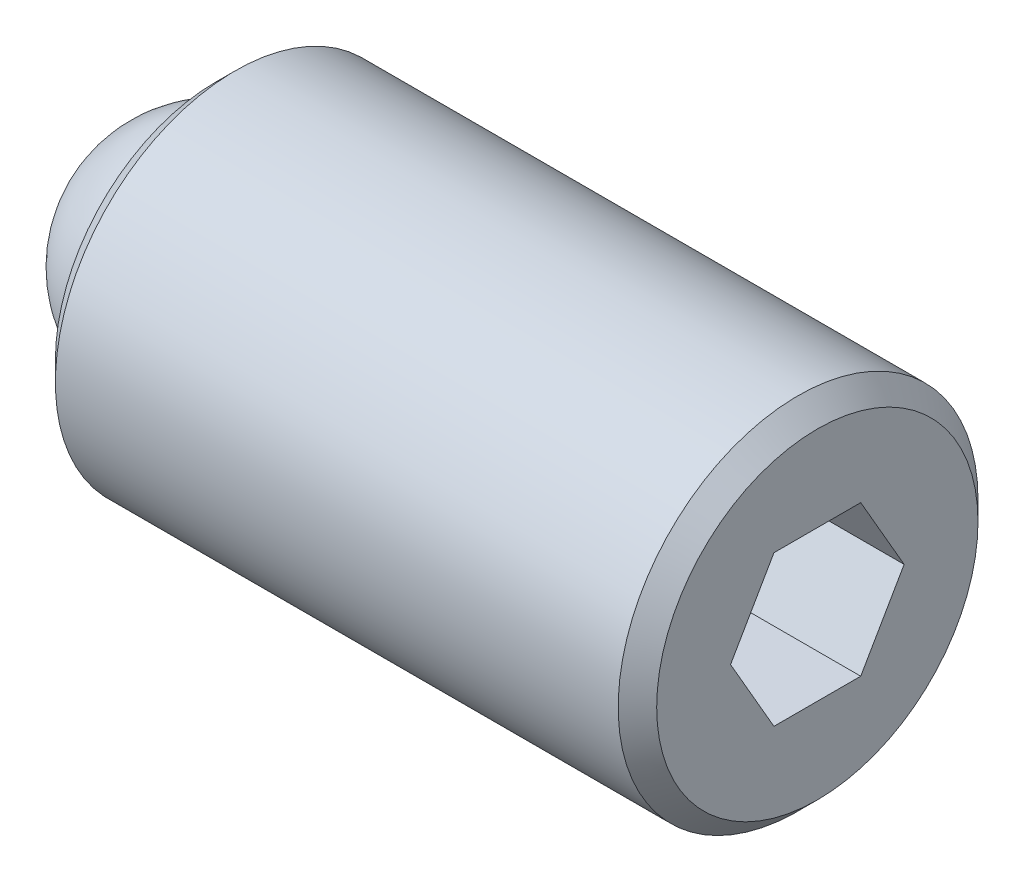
ISO-10303-21;
HEADER;
FILE_DESCRIPTION(('STEP AP214'),'2;1');
FILE_NAME('part.step','',(''),(''),'','','');
FILE_SCHEMA(('AUTOMOTIVE_DESIGN { 1 0 10303 214 1 1 1 1 }'));
ENDSEC;
DATA;
#1=APPLICATION_CONTEXT('core data for automotive mechanical design processes');
#2=APPLICATION_PROTOCOL_DEFINITION('international standard','automotive_design',2000,#1);
#3=PRODUCT_CONTEXT('',#1,'mechanical');
#4=PRODUCT('Part','Part','',(#3));
#5=PRODUCT_RELATED_PRODUCT_CATEGORY('part','',(#4));
#6=PRODUCT_DEFINITION_FORMATION('','',#4);
#7=PRODUCT_DEFINITION_CONTEXT('part definition',#1,'design');
#8=PRODUCT_DEFINITION('design','',#6,#7);
#9=PRODUCT_DEFINITION_SHAPE('','',#8);
#10=(LENGTH_UNIT() NAMED_UNIT(*) SI_UNIT(.MILLI.,.METRE.));
#11=(NAMED_UNIT(*) PLANE_ANGLE_UNIT() SI_UNIT($,.RADIAN.));
#12=(NAMED_UNIT(*) SI_UNIT($,.STERADIAN.) SOLID_ANGLE_UNIT());
#13=UNCERTAINTY_MEASURE_WITH_UNIT(LENGTH_MEASURE(1.E-05),#10,'distance_accuracy_value','');
#14=(GEOMETRIC_REPRESENTATION_CONTEXT(3) GLOBAL_UNCERTAINTY_ASSIGNED_CONTEXT((#13)) GLOBAL_UNIT_ASSIGNED_CONTEXT((#10,
#11,#12)) REPRESENTATION_CONTEXT('',''));
#15=CARTESIAN_POINT('',(0.,0.,0.));
#16=DIRECTION('',(0.,0.,1.));
#17=DIRECTION('',(1.,0.,0.));
#18=AXIS2_PLACEMENT_3D('',#15,#16,#17);
#19=CARTESIAN_POINT('',(0.,0.,0.));
#20=DIRECTION('',(0.,-1.,0.));
#21=DIRECTION('',(0.,0.,1.));
#22=AXIS2_PLACEMENT_3D('',#19,#20,#21);
#23=SPHERICAL_SURFACE('',#22,1.5875);
#24=CARTESIAN_POINT('',(0.,-1.5875,0.));
#25=VERTEX_POINT('',#24);
#26=VERTEX_LOOP('',#25);
#27=FACE_BOUND('',#26,.T.);
#28=ADVANCED_FACE('F40',(#27),#23,.T.);
#29=CLOSED_SHELL('',(#28));
#30=MANIFOLD_SOLID_BREP('B2',#29);
#31=CARTESIAN_POINT('',(7.9375,0.,0.));
#32=DIRECTION('',(-1.,0.,0.));
#33=DIRECTION('',(0.,0.,1.));
#34=AXIS2_PLACEMENT_3D('',#31,#32,#33);
#35=CYLINDRICAL_SURFACE('',#34,2.3749);
#36=CARTESIAN_POINT('',(7.6835,0.,0.));
#37=DIRECTION('',(1.,0.,0.));
#38=DIRECTION('',(0.,0.,-1.));
#39=AXIS2_PLACEMENT_3D('',#36,#37,#38);
#40=CIRCLE('',#39,2.3749);
#41=CARTESIAN_POINT('',(7.6835,0.,-2.3749));
#42=VERTEX_POINT('',#41);
#43=EDGE_CURVE('E38',#42,#42,#40,.F.);
#44=ORIENTED_EDGE('',*,*,#43,.T.);
#45=EDGE_LOOP('',(#44));
#46=FACE_BOUND('',#45,.T.);
#47=CARTESIAN_POINT('',(0.254,0.,0.));
#48=DIRECTION('',(1.,0.,0.));
#49=DIRECTION('',(0.,0.,-1.));
#50=AXIS2_PLACEMENT_3D('',#47,#48,#49);
#51=CIRCLE('',#50,2.3749);
#52=CARTESIAN_POINT('',(0.254,0.,-2.3749));
#53=VERTEX_POINT('',#52);
#54=EDGE_CURVE('E155',#53,#53,#51,.T.);
#55=ORIENTED_EDGE('',*,*,#54,.T.);
#56=EDGE_LOOP('',(#55));
#57=FACE_BOUND('',#56,.T.);
#58=ADVANCED_FACE('F52',(#46,#57),#35,.T.);
#59=CARTESIAN_POINT('',(7.9375,0.,0.));
#60=DIRECTION('',(1.,0.,0.));
#61=DIRECTION('',(0.,0.,-1.));
#62=AXIS2_PLACEMENT_3D('',#59,#60,#61);
#63=PLANE('',#62);
#64=DIRECTION('',(0.,0.866025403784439,-0.5));
#65=VECTOR('',#64,1.);
#66=CARTESIAN_POINT('',(7.9375,-0.992187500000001,-0.572839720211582));
#67=LINE('',#66,#65);
#68=CARTESIAN_POINT('',(7.9375,-0.992187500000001,-0.572839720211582));
#69=VERTEX_POINT('',#68);
#70=CARTESIAN_POINT('',(7.9375,0.,-1.14567944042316));
#71=VERTEX_POINT('',#70);
#72=EDGE_CURVE('E67',#69,#71,#67,.T.);
#73=ORIENTED_EDGE('',*,*,#72,.F.);
#74=DIRECTION('',(0.,0.,-1.));
#75=VECTOR('',#74,1.);
#76=CARTESIAN_POINT('',(7.9375,-0.992187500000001,0.572839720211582));
#77=LINE('',#76,#75);
#78=CARTESIAN_POINT('',(7.9375,-0.992187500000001,0.572839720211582));
#79=VERTEX_POINT('',#78);
#80=EDGE_CURVE('E151',#79,#69,#77,.T.);
#81=ORIENTED_EDGE('',*,*,#80,.F.);
#82=DIRECTION('',(0.,-0.866025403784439,-0.5));
#83=VECTOR('',#82,1.);
#84=CARTESIAN_POINT('',(7.9375,0.,1.14567944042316));
#85=LINE('',#84,#83);
#86=CARTESIAN_POINT('',(7.9375,0.,1.14567944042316));
#87=VERTEX_POINT('',#86);
#88=EDGE_CURVE('E149',#87,#79,#85,.T.);
#89=ORIENTED_EDGE('',*,*,#88,.F.);
#90=DIRECTION('',(0.,-0.866025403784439,0.5));
#91=VECTOR('',#90,1.);
#92=CARTESIAN_POINT('',(7.9375,0.992187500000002,0.572839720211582));
#93=LINE('',#92,#91);
#94=CARTESIAN_POINT('',(7.9375,0.992187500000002,0.572839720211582));
#95=VERTEX_POINT('',#94);
#96=EDGE_CURVE('E115',#95,#87,#93,.T.);
#97=ORIENTED_EDGE('',*,*,#96,.F.);
#98=DIRECTION('',(0.,0.,1.));
#99=VECTOR('',#98,1.);
#100=CARTESIAN_POINT('',(7.9375,0.992187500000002,-0.572839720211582));
#101=LINE('',#100,#99);
#102=CARTESIAN_POINT('',(7.9375,0.992187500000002,-0.572839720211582));
#103=VERTEX_POINT('',#102);
#104=EDGE_CURVE('E145',#103,#95,#101,.T.);
#105=ORIENTED_EDGE('',*,*,#104,.F.);
#106=DIRECTION('',(0.,0.866025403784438,0.5));
#107=VECTOR('',#106,1.);
#108=CARTESIAN_POINT('',(7.9375,0.,-1.14567944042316));
#109=LINE('',#108,#107);
#110=EDGE_CURVE('E141',#71,#103,#109,.T.);
#111=ORIENTED_EDGE('',*,*,#110,.F.);
#112=EDGE_LOOP('',(#73,#81,#89,#97,#105,#111));
#113=FACE_BOUND('',#112,.T.);
#114=CARTESIAN_POINT('',(7.9375,0.,0.));
#115=DIRECTION('',(1.,0.,0.));
#116=DIRECTION('',(0.,0.,-1.));
#117=AXIS2_PLACEMENT_3D('',#114,#115,#116);
#118=CIRCLE('',#117,2.1209);
#119=CARTESIAN_POINT('',(7.9375,0.,-2.1209));
#120=VERTEX_POINT('',#119);
#121=EDGE_CURVE('E60',#120,#120,#118,.T.);
#122=ORIENTED_EDGE('',*,*,#121,.T.);
#123=EDGE_LOOP('',(#122));
#124=FACE_BOUND('',#123,.T.);
#125=ADVANCED_FACE('F168',(#113,#124),#63,.T.);
#126=CARTESIAN_POINT('',(0.,0.,0.));
#127=DIRECTION('',(1.,0.,0.));
#128=DIRECTION('',(0.,0.,-1.));
#129=AXIS2_PLACEMENT_3D('',#126,#127,#128);
#130=PLANE('',#129);
#131=CARTESIAN_POINT('',(0.,0.,0.));
#132=DIRECTION('',(-1.,0.,0.));
#133=DIRECTION('',(0.,0.,1.));
#134=AXIS2_PLACEMENT_3D('',#131,#132,#133);
#135=CIRCLE('',#134,1.5875);
#136=CARTESIAN_POINT('',(0.,0.,1.5875));
#137=VERTEX_POINT('',#136);
#138=EDGE_CURVE('E223',#137,#137,#135,.T.);
#139=ORIENTED_EDGE('',*,*,#138,.F.);
#140=EDGE_LOOP('',(#139));
#141=FACE_BOUND('',#140,.T.);
#142=CARTESIAN_POINT('',(0.,0.,0.));
#143=DIRECTION('',(1.,0.,0.));
#144=DIRECTION('',(0.,0.,-1.));
#145=AXIS2_PLACEMENT_3D('',#142,#143,#144);
#146=CIRCLE('',#145,2.1209);
#147=CARTESIAN_POINT('',(0.,0.,-2.1209));
#148=VERTEX_POINT('',#147);
#149=EDGE_CURVE('E163',#148,#148,#146,.F.);
#150=ORIENTED_EDGE('',*,*,#149,.T.);
#151=EDGE_LOOP('',(#150));
#152=FACE_BOUND('',#151,.T.);
#153=ADVANCED_FACE('F180',(#141,#152),#130,.F.);
#154=CARTESIAN_POINT('',(0.254,0.,0.));
#155=DIRECTION('',(1.,0.,0.));
#156=DIRECTION('',(0.,0.,-1.));
#157=AXIS2_PLACEMENT_3D('',#154,#155,#156);
#158=CONICAL_SURFACE('',#157,2.3749,0.785398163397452);
#159=ORIENTED_EDGE('',*,*,#149,.F.);
#160=EDGE_LOOP('',(#159));
#161=FACE_BOUND('',#160,.T.);
#162=ORIENTED_EDGE('',*,*,#54,.F.);
#163=EDGE_LOOP('',(#162));
#164=FACE_BOUND('',#163,.T.);
#165=ADVANCED_FACE('F172',(#161,#164),#158,.T.);
#166=CARTESIAN_POINT('',(7.9375,0.,0.));
#167=DIRECTION('',(-1.,0.,0.));
#168=DIRECTION('',(0.,0.,1.));
#169=AXIS2_PLACEMENT_3D('',#166,#167,#168);
#170=CONICAL_SURFACE('',#169,2.1209,0.785398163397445);
#171=ORIENTED_EDGE('',*,*,#43,.F.);
#172=EDGE_LOOP('',(#171));
#173=FACE_BOUND('',#172,.T.);
#174=ORIENTED_EDGE('',*,*,#121,.F.);
#175=EDGE_LOOP('',(#174));
#176=FACE_BOUND('',#175,.T.);
#177=ADVANCED_FACE('F54',(#173,#176),#170,.T.);
#178=CARTESIAN_POINT('',(5.6515,-0.992187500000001,-0.572839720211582));
#179=DIRECTION('',(0.,-0.5,-0.866025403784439));
#180=DIRECTION('',(0.,0.866025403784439,-0.5));
#181=AXIS2_PLACEMENT_3D('',#178,#179,#180);
#182=PLANE('',#181);
#183=ORIENTED_EDGE('',*,*,#72,.T.);
#184=DIRECTION('',(1.,0.,0.));
#185=VECTOR('',#184,1.);
#186=CARTESIAN_POINT('',(5.6515,0.,-1.14567944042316));
#187=LINE('',#186,#185);
#188=CARTESIAN_POINT('',(5.6515,0.,-1.14567944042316));
#189=VERTEX_POINT('',#188);
#190=EDGE_CURVE('E97',#189,#71,#187,.T.);
#191=ORIENTED_EDGE('',*,*,#190,.F.);
#192=DIRECTION('',(0.,0.866025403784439,-0.5));
#193=VECTOR('',#192,1.);
#194=CARTESIAN_POINT('',(5.6515,-0.992187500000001,-0.572839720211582));
#195=LINE('',#194,#193);
#196=CARTESIAN_POINT('',(5.6515,-0.992187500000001,-0.572839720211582));
#197=VERTEX_POINT('',#196);
#198=EDGE_CURVE('E153',#197,#189,#195,.T.);
#199=ORIENTED_EDGE('',*,*,#198,.F.);
#200=DIRECTION('',(1.,0.,0.));
#201=VECTOR('',#200,1.);
#202=CARTESIAN_POINT('',(5.6515,-0.992187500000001,-0.572839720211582));
#203=LINE('',#202,#201);
#204=EDGE_CURVE('E75',#197,#69,#203,.T.);
#205=ORIENTED_EDGE('',*,*,#204,.T.);
#206=EDGE_LOOP('',(#183,#191,#199,#205));
#207=FACE_BOUND('',#206,.T.);
#208=ADVANCED_FACE('F171',(#207),#182,.F.);
#209=CARTESIAN_POINT('',(5.6515,-0.992187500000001,0.572839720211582));
#210=DIRECTION('',(0.,-1.,0.));
#211=DIRECTION('',(0.,0.,-1.));
#212=AXIS2_PLACEMENT_3D('',#209,#210,#211);
#213=PLANE('',#212);
#214=ORIENTED_EDGE('',*,*,#80,.T.);
#215=ORIENTED_EDGE('',*,*,#204,.F.);
#216=DIRECTION('',(0.,0.,-1.));
#217=VECTOR('',#216,1.);
#218=CARTESIAN_POINT('',(5.6515,-0.992187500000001,0.572839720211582));
#219=LINE('',#218,#217);
#220=CARTESIAN_POINT('',(5.6515,-0.992187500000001,0.572839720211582));
#221=VERTEX_POINT('',#220);
#222=EDGE_CURVE('E127',#221,#197,#219,.T.);
#223=ORIENTED_EDGE('',*,*,#222,.F.);
#224=DIRECTION('',(1.,0.,0.));
#225=VECTOR('',#224,1.);
#226=CARTESIAN_POINT('',(5.6515,-0.992187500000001,0.572839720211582));
#227=LINE('',#226,#225);
#228=EDGE_CURVE('E119',#221,#79,#227,.T.);
#229=ORIENTED_EDGE('',*,*,#228,.T.);
#230=EDGE_LOOP('',(#214,#215,#223,#229));
#231=FACE_BOUND('',#230,.T.);
#232=ADVANCED_FACE('F178',(#231),#213,.F.);
#233=CARTESIAN_POINT('',(5.6515,0.,1.14567944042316));
#234=DIRECTION('',(0.,-0.5,0.866025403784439));
#235=DIRECTION('',(0.,-0.866025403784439,-0.5));
#236=AXIS2_PLACEMENT_3D('',#233,#234,#235);
#237=PLANE('',#236);
#238=ORIENTED_EDGE('',*,*,#88,.T.);
#239=ORIENTED_EDGE('',*,*,#228,.F.);
#240=DIRECTION('',(0.,-0.866025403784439,-0.5));
#241=VECTOR('',#240,1.);
#242=CARTESIAN_POINT('',(5.6515,0.,1.14567944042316));
#243=LINE('',#242,#241);
#244=CARTESIAN_POINT('',(5.6515,0.,1.14567944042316));
#245=VERTEX_POINT('',#244);
#246=EDGE_CURVE('E123',#245,#221,#243,.T.);
#247=ORIENTED_EDGE('',*,*,#246,.F.);
#248=DIRECTION('',(1.,0.,0.));
#249=VECTOR('',#248,1.);
#250=CARTESIAN_POINT('',(5.6515,0.,1.14567944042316));
#251=LINE('',#250,#249);
#252=EDGE_CURVE('E108',#245,#87,#251,.T.);
#253=ORIENTED_EDGE('',*,*,#252,.T.);
#254=EDGE_LOOP('',(#238,#239,#247,#253));
#255=FACE_BOUND('',#254,.T.);
#256=ADVANCED_FACE('F124',(#255),#237,.F.);
#257=CARTESIAN_POINT('',(5.6515,0.992187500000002,0.572839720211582));
#258=DIRECTION('',(0.,0.5,0.866025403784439));
#259=DIRECTION('',(0.,-0.866025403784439,0.5));
#260=AXIS2_PLACEMENT_3D('',#257,#258,#259);
#261=PLANE('',#260);
#262=ORIENTED_EDGE('',*,*,#96,.T.);
#263=ORIENTED_EDGE('',*,*,#252,.F.);
#264=DIRECTION('',(0.,-0.866025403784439,0.5));
#265=VECTOR('',#264,1.);
#266=CARTESIAN_POINT('',(5.6515,0.992187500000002,0.572839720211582));
#267=LINE('',#266,#265);
#268=CARTESIAN_POINT('',(5.6515,0.992187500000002,0.572839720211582));
#269=VERTEX_POINT('',#268);
#270=EDGE_CURVE('E112',#269,#245,#267,.T.);
#271=ORIENTED_EDGE('',*,*,#270,.F.);
#272=DIRECTION('',(1.,0.,0.));
#273=VECTOR('',#272,1.);
#274=CARTESIAN_POINT('',(5.6515,0.992187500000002,0.572839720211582));
#275=LINE('',#274,#273);
#276=EDGE_CURVE('E120',#269,#95,#275,.T.);
#277=ORIENTED_EDGE('',*,*,#276,.T.);
#278=EDGE_LOOP('',(#262,#263,#271,#277));
#279=FACE_BOUND('',#278,.T.);
#280=ADVANCED_FACE('F110',(#279),#261,.F.);
#281=CARTESIAN_POINT('',(5.6515,0.992187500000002,-0.572839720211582));
#282=DIRECTION('',(0.,1.,0.));
#283=DIRECTION('',(0.,0.,1.));
#284=AXIS2_PLACEMENT_3D('',#281,#282,#283);
#285=PLANE('',#284);
#286=ORIENTED_EDGE('',*,*,#104,.T.);
#287=ORIENTED_EDGE('',*,*,#276,.F.);
#288=DIRECTION('',(0.,0.,1.));
#289=VECTOR('',#288,1.);
#290=CARTESIAN_POINT('',(5.6515,0.992187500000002,-0.572839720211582));
#291=LINE('',#290,#289);
#292=CARTESIAN_POINT('',(5.6515,0.992187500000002,-0.572839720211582));
#293=VERTEX_POINT('',#292);
#294=EDGE_CURVE('E133',#293,#269,#291,.T.);
#295=ORIENTED_EDGE('',*,*,#294,.F.);
#296=DIRECTION('',(1.,0.,0.));
#297=VECTOR('',#296,1.);
#298=CARTESIAN_POINT('',(5.6515,0.992187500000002,-0.572839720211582));
#299=LINE('',#298,#297);
#300=EDGE_CURVE('E158',#293,#103,#299,.T.);
#301=ORIENTED_EDGE('',*,*,#300,.T.);
#302=EDGE_LOOP('',(#286,#287,#295,#301));
#303=FACE_BOUND('',#302,.T.);
#304=ADVANCED_FACE('F199',(#303),#285,.F.);
#305=CARTESIAN_POINT('',(5.6515,0.,-1.14567944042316));
#306=DIRECTION('',(0.,0.5,-0.866025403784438));
#307=DIRECTION('',(0.,0.866025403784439,0.5));
#308=AXIS2_PLACEMENT_3D('',#305,#306,#307);
#309=PLANE('',#308);
#310=ORIENTED_EDGE('',*,*,#110,.T.);
#311=ORIENTED_EDGE('',*,*,#300,.F.);
#312=DIRECTION('',(0.,0.866025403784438,0.5));
#313=VECTOR('',#312,1.);
#314=CARTESIAN_POINT('',(5.6515,0.,-1.14567944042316));
#315=LINE('',#314,#313);
#316=EDGE_CURVE('E135',#189,#293,#315,.T.);
#317=ORIENTED_EDGE('',*,*,#316,.F.);
#318=ORIENTED_EDGE('',*,*,#190,.T.);
#319=EDGE_LOOP('',(#310,#311,#317,#318));
#320=FACE_BOUND('',#319,.T.);
#321=ADVANCED_FACE('F196',(#320),#309,.F.);
#322=CARTESIAN_POINT('',(5.6515,0.,0.));
#323=DIRECTION('',(1.,0.,0.));
#324=DIRECTION('',(0.,0.,-1.));
#325=AXIS2_PLACEMENT_3D('',#322,#323,#324);
#326=PLANE('',#325);
#327=ORIENTED_EDGE('',*,*,#198,.T.);
#328=ORIENTED_EDGE('',*,*,#316,.T.);
#329=ORIENTED_EDGE('',*,*,#294,.T.);
#330=ORIENTED_EDGE('',*,*,#270,.T.);
#331=ORIENTED_EDGE('',*,*,#246,.T.);
#332=ORIENTED_EDGE('',*,*,#222,.T.);
#333=EDGE_LOOP('',(#327,#328,#329,#330,#331,#332));
#334=FACE_BOUND('',#333,.T.);
#335=ADVANCED_FACE('F130',(#334),#326,.T.);
#336=CARTESIAN_POINT('',(1.5875,0.,0.));
#337=DIRECTION('',(-1.,0.,0.));
#338=DIRECTION('',(0.,0.,1.));
#339=AXIS2_PLACEMENT_3D('',#336,#337,#338);
#340=CYLINDRICAL_SURFACE('',#339,1.5875);
#341=CARTESIAN_POINT('',(1.5875,0.,0.));
#342=DIRECTION('',(-1.,0.,0.));
#343=DIRECTION('',(0.,0.,1.));
#344=AXIS2_PLACEMENT_3D('',#341,#342,#343);
#345=CIRCLE('',#344,1.5875);
#346=CARTESIAN_POINT('',(1.5875,0.,1.5875));
#347=VERTEX_POINT('',#346);
#348=EDGE_CURVE('E142',#347,#347,#345,.T.);
#349=ORIENTED_EDGE('',*,*,#348,.F.);
#350=EDGE_LOOP('',(#349));
#351=FACE_BOUND('',#350,.T.);
#352=ORIENTED_EDGE('',*,*,#138,.T.);
#353=EDGE_LOOP('',(#352));
#354=FACE_BOUND('',#353,.T.);
#355=ADVANCED_FACE('F212',(#351,#354),#340,.F.);
#356=CARTESIAN_POINT('',(1.5875,0.,0.));
#357=DIRECTION('',(-1.,0.,0.));
#358=DIRECTION('',(0.,0.,1.));
#359=AXIS2_PLACEMENT_3D('',#356,#357,#358);
#360=PLANE('',#359);
#361=ORIENTED_EDGE('',*,*,#348,.T.);
#362=EDGE_LOOP('',(#361));
#363=FACE_BOUND('',#362,.T.);
#364=ADVANCED_FACE('F215',(#363),#360,.T.);
#365=CLOSED_SHELL('',(#58,#125,#153,#165,#177,#208,#232,#256,#280,#304,#321,#335,#355,#364));
#366=MANIFOLD_SOLID_BREP('B6',#365);
#367=ADVANCED_BREP_SHAPE_REPRESENTATION('',(#18,#30,#366),#14);
#368=SHAPE_DEFINITION_REPRESENTATION(#9,#367);
ENDSEC;
END-ISO-10303-21;
